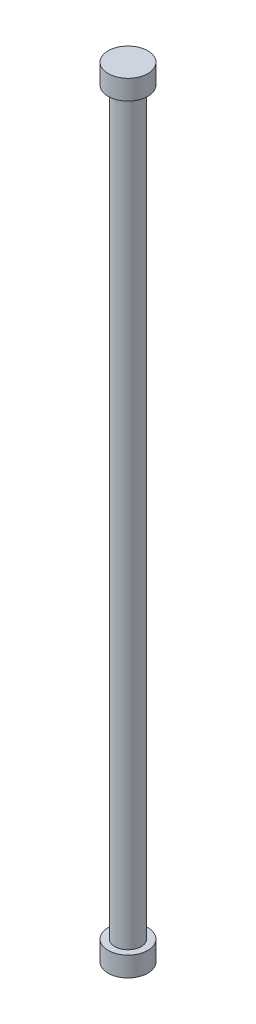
from build123d import *

# Parameters (mm, degrees)
SKETCH1_R           = 15
BOSS_EXTRUDE1_DEPTH = 15
SKETCH2_R           = 10
BOSS_EXTRUDE2_DEPTH = 560.5
SKETCH3_R           = 15
BOSS_EXTRUDE3_DEPTH = 15


with BuildPart() as part:
    # Sketch1 → Boss-Extrude1 (new body)
    with BuildSketch(Plane(origin=(0, 0, 0), x_dir=(-1, 0, 0), z_dir=(0, 1, 0))):
        with Locations(Location((0, 0, 0), (0, 0, 90))):
            Circle(SKETCH1_R)
    extrude(amount=BOSS_EXTRUDE1_DEPTH)

    # Sketch2 → Boss-Extrude2 (add)
    with BuildSketch(Plane(origin=(0, 15, 0), x_dir=(-1, 0, 0), z_dir=(0, 1, 0))):
        with Locations(Location((0, 0, 0), (0, 0, 90))):
            Circle(SKETCH2_R)
    extrude(amount=BOSS_EXTRUDE2_DEPTH)

    # Sketch3 → Boss-Extrude3 (add)
    with BuildSketch(Plane(origin=(0, 575.5, 0), x_dir=(-1, 0, 0), z_dir=(0, 1, 0))):
        with Locations(Location((0, 0, 0), (0, 0, 90))):
            Circle(SKETCH3_R)
    extrude(amount=BOSS_EXTRUDE3_DEPTH)


solid = part.part
